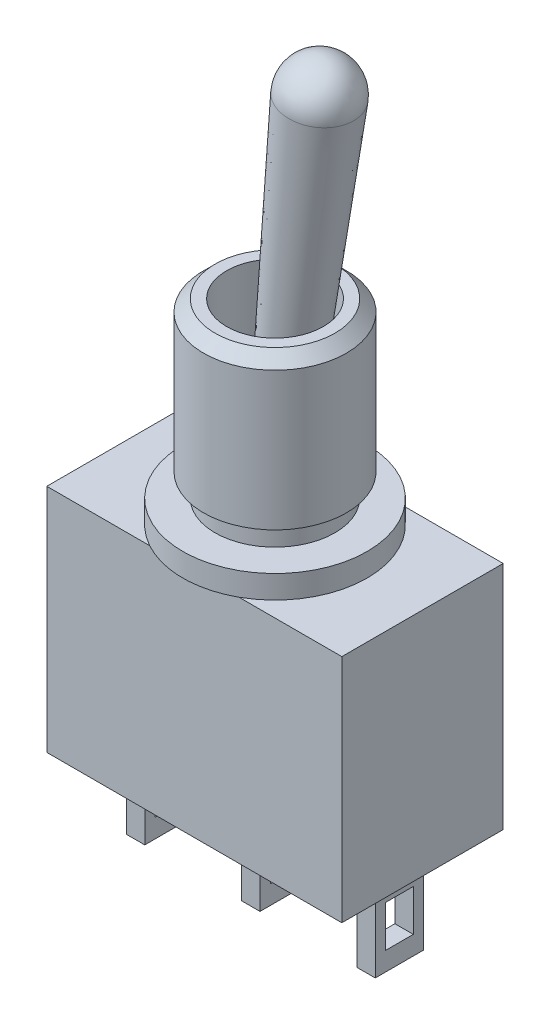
ISO-10303-21;
HEADER;
FILE_DESCRIPTION(('STEP AP214'),'2;1');
FILE_NAME('part.step','',(''),(''),'','','');
FILE_SCHEMA(('AUTOMOTIVE_DESIGN { 1 0 10303 214 1 1 1 1 }'));
ENDSEC;
DATA;
#1=APPLICATION_CONTEXT('core data for automotive mechanical design processes');
#2=APPLICATION_PROTOCOL_DEFINITION('international standard','automotive_design',2000,#1);
#3=PRODUCT_CONTEXT('',#1,'mechanical');
#4=PRODUCT('Part','Part','',(#3));
#5=PRODUCT_RELATED_PRODUCT_CATEGORY('part','',(#4));
#6=PRODUCT_DEFINITION_FORMATION('','',#4);
#7=PRODUCT_DEFINITION_CONTEXT('part definition',#1,'design');
#8=PRODUCT_DEFINITION('design','',#6,#7);
#9=PRODUCT_DEFINITION_SHAPE('','',#8);
#10=(LENGTH_UNIT() NAMED_UNIT(*) SI_UNIT(.MILLI.,.METRE.));
#11=(NAMED_UNIT(*) PLANE_ANGLE_UNIT() SI_UNIT($,.RADIAN.));
#12=(NAMED_UNIT(*) SI_UNIT($,.STERADIAN.) SOLID_ANGLE_UNIT());
#13=UNCERTAINTY_MEASURE_WITH_UNIT(LENGTH_MEASURE(1.E-05),#10,'distance_accuracy_value','');
#14=(GEOMETRIC_REPRESENTATION_CONTEXT(3) GLOBAL_UNCERTAINTY_ASSIGNED_CONTEXT((#13)) GLOBAL_UNIT_ASSIGNED_CONTEXT((#10,
#11,#12)) REPRESENTATION_CONTEXT('',''));
#15=CARTESIAN_POINT('',(0.,0.,0.));
#16=DIRECTION('',(0.,0.,1.));
#17=DIRECTION('',(1.,0.,0.));
#18=AXIS2_PLACEMENT_3D('',#15,#16,#17);
#19=CARTESIAN_POINT('',(0.727270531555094,6.02371910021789,0.));
#20=DIRECTION('',(-0.119864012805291,-0.992790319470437,0.));
#21=DIRECTION('',(0.992790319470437,-0.119864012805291,0.));
#22=AXIS2_PLACEMENT_3D('',#19,#20,#21);
#23=PLANE('',#22);
#24=CARTESIAN_POINT('',(0.,6.11152572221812,0.));
#25=DIRECTION('',(-0.119864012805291,-0.992790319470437,0.));
#26=DIRECTION('',(0.992790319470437,-0.119864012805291,0.));
#27=AXIS2_PLACEMENT_3D('',#24,#25,#26);
#28=CIRCLE('',#27,0.930435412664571);
#29=CARTESIAN_POINT('',(0.923727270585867,6.,0.));
#30=VERTEX_POINT('',#29);
#31=EDGE_CURVE('E11',#30,#30,#28,.T.);
#32=ORIENTED_EDGE('',*,*,#31,.T.);
#33=EDGE_LOOP('',(#32));
#34=FACE_BOUND('',#33,.T.);
#35=ADVANCED_FACE('F42',(#34),#23,.T.);
#36=CARTESIAN_POINT('',(1.9268527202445,22.0709507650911,0.));
#37=DIRECTION('',(0.119864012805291,0.992790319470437,0.));
#38=DIRECTION('',(-0.992790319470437,0.119864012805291,0.));
#39=AXIS2_PLACEMENT_3D('',#36,#37,#38);
#40=CONICAL_SURFACE('',#39,1.5,0.0354161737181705);
#41=ORIENTED_EDGE('',*,*,#31,.F.);
#42=EDGE_LOOP('',(#41));
#43=FACE_BOUND('',#42,.T.);
#44=CARTESIAN_POINT('',(1.9268527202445,22.0709507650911,0.));
#45=DIRECTION('',(-0.119864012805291,-0.992790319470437,0.));
#46=DIRECTION('',(0.992790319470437,-0.119864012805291,0.));
#47=AXIS2_PLACEMENT_3D('',#44,#45,#46);
#48=CIRCLE('',#47,1.5);
#49=CARTESIAN_POINT('',(3.41603819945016,21.8911547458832,0.));
#50=VERTEX_POINT('',#49);
#51=EDGE_CURVE('E48',#50,#50,#48,.T.);
#52=ORIENTED_EDGE('',*,*,#51,.T.);
#53=EDGE_LOOP('',(#52));
#54=FACE_BOUND('',#53,.T.);
#55=ADVANCED_FACE('F54',(#43,#54),#40,.T.);
#56=CARTESIAN_POINT('',(1.93322307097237,22.123714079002,0.));
#57=DIRECTION('',(-0.119864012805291,-0.992790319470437,0.));
#58=DIRECTION('',(-0.992790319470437,0.119864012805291,0.));
#59=AXIS2_PLACEMENT_3D('',#56,#57,#58);
#60=SPHERICAL_SURFACE('',#59,1.50094122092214);
#61=ORIENTED_EDGE('',*,*,#51,.F.);
#62=EDGE_LOOP('',(#61));
#63=FACE_BOUND('',#62,.T.);
#64=ADVANCED_FACE('F56',(#63),#60,.T.);
#65=CLOSED_SHELL('',(#35,#55,#64));
#66=MANIFOLD_SOLID_BREP('B2',#65);
#67=CARTESIAN_POINT('',(6.4,-5.,3.5));
#68=DIRECTION('',(0.,1.,0.));
#69=DIRECTION('',(-1.,0.,0.));
#70=AXIS2_PLACEMENT_3D('',#67,#68,#69);
#71=PLANE('',#70);
#72=DIRECTION('',(-1.,0.,0.));
#73=VECTOR('',#72,1.);
#74=CARTESIAN_POINT('',(-4.6,-5.,1.05));
#75=LINE('',#74,#73);
#76=CARTESIAN_POINT('',(-4.6,-5.,1.05));
#77=VERTEX_POINT('',#76);
#78=CARTESIAN_POINT('',(-5.4,-5.,1.05));
#79=VERTEX_POINT('',#78);
#80=EDGE_CURVE('E394',#77,#79,#75,.T.);
#81=ORIENTED_EDGE('',*,*,#80,.F.);
#82=DIRECTION('',(0.,0.,1.));
#83=VECTOR('',#82,1.);
#84=CARTESIAN_POINT('',(-4.6,-5.,-1.05));
#85=LINE('',#84,#83);
#86=CARTESIAN_POINT('',(-4.6,-5.,-1.05));
#87=VERTEX_POINT('',#86);
#88=EDGE_CURVE('E391',#87,#77,#85,.T.);
#89=ORIENTED_EDGE('',*,*,#88,.F.);
#90=DIRECTION('',(-1.,0.,0.));
#91=VECTOR('',#90,1.);
#92=CARTESIAN_POINT('',(-4.6,-5.,-1.05));
#93=LINE('',#92,#91);
#94=CARTESIAN_POINT('',(-5.4,-5.,-1.05));
#95=VERTEX_POINT('',#94);
#96=EDGE_CURVE('E405',#87,#95,#93,.T.);
#97=ORIENTED_EDGE('',*,*,#96,.T.);
#98=DIRECTION('',(0.,0.,1.));
#99=VECTOR('',#98,1.);
#100=CARTESIAN_POINT('',(-5.4,-5.,-1.05));
#101=LINE('',#100,#99);
#102=EDGE_CURVE('E386',#95,#79,#101,.T.);
#103=ORIENTED_EDGE('',*,*,#102,.T.);
#104=EDGE_LOOP('',(#81,#89,#97,#103));
#105=FACE_BOUND('',#104,.T.);
#106=DIRECTION('',(1.,0.,0.));
#107=VECTOR('',#106,1.);
#108=CARTESIAN_POINT('',(6.4,-5.,-3.5));
#109=LINE('',#108,#107);
#110=CARTESIAN_POINT('',(-6.4,-5.,-3.5));
#111=VERTEX_POINT('',#110);
#112=CARTESIAN_POINT('',(6.4,-5.,-3.5));
#113=VERTEX_POINT('',#112);
#114=EDGE_CURVE('E519',#111,#113,#109,.T.);
#115=ORIENTED_EDGE('',*,*,#114,.T.);
#116=DIRECTION('',(0.,0.,-1.));
#117=VECTOR('',#116,1.);
#118=CARTESIAN_POINT('',(6.4,-5.,3.5));
#119=LINE('',#118,#117);
#120=CARTESIAN_POINT('',(6.4,-5.,3.5));
#121=VERTEX_POINT('',#120);
#122=EDGE_CURVE('E531',#121,#113,#119,.T.);
#123=ORIENTED_EDGE('',*,*,#122,.F.);
#124=DIRECTION('',(1.,0.,0.));
#125=VECTOR('',#124,1.);
#126=CARTESIAN_POINT('',(6.4,-5.,3.5));
#127=LINE('',#126,#125);
#128=CARTESIAN_POINT('',(-6.4,-5.,3.5));
#129=VERTEX_POINT('',#128);
#130=EDGE_CURVE('E506',#129,#121,#127,.T.);
#131=ORIENTED_EDGE('',*,*,#130,.F.);
#132=DIRECTION('',(0.,0.,-1.));
#133=VECTOR('',#132,1.);
#134=CARTESIAN_POINT('',(-6.4,-5.,3.5));
#135=LINE('',#134,#133);
#136=EDGE_CURVE('E86',#129,#111,#135,.T.);
#137=ORIENTED_EDGE('',*,*,#136,.T.);
#138=EDGE_LOOP('',(#115,#123,#131,#137));
#139=FACE_BOUND('',#138,.T.);
#140=DIRECTION('',(-1.,0.,0.));
#141=VECTOR('',#140,1.);
#142=CARTESIAN_POINT('',(0.4,-5.,1.05));
#143=LINE('',#142,#141);
#144=CARTESIAN_POINT('',(0.4,-5.,1.05));
#145=VERTEX_POINT('',#144);
#146=CARTESIAN_POINT('',(-0.4,-5.,1.05));
#147=VERTEX_POINT('',#146);
#148=EDGE_CURVE('E457',#145,#147,#143,.T.);
#149=ORIENTED_EDGE('',*,*,#148,.F.);
#150=DIRECTION('',(0.,0.,1.));
#151=VECTOR('',#150,1.);
#152=CARTESIAN_POINT('',(0.4,-5.,-1.05));
#153=LINE('',#152,#151);
#154=CARTESIAN_POINT('',(0.4,-5.,-1.05));
#155=VERTEX_POINT('',#154);
#156=EDGE_CURVE('E454',#155,#145,#153,.T.);
#157=ORIENTED_EDGE('',*,*,#156,.F.);
#158=DIRECTION('',(-1.,0.,0.));
#159=VECTOR('',#158,1.);
#160=CARTESIAN_POINT('',(0.4,-5.,-1.05));
#161=LINE('',#160,#159);
#162=CARTESIAN_POINT('',(-0.4,-5.,-1.05));
#163=VERTEX_POINT('',#162);
#164=EDGE_CURVE('E468',#155,#163,#161,.T.);
#165=ORIENTED_EDGE('',*,*,#164,.T.);
#166=DIRECTION('',(0.,0.,1.));
#167=VECTOR('',#166,1.);
#168=CARTESIAN_POINT('',(-0.4,-5.,-1.05));
#169=LINE('',#168,#167);
#170=EDGE_CURVE('E449',#163,#147,#169,.T.);
#171=ORIENTED_EDGE('',*,*,#170,.T.);
#172=EDGE_LOOP('',(#149,#157,#165,#171));
#173=FACE_BOUND('',#172,.T.);
#174=DIRECTION('',(-1.,0.,0.));
#175=VECTOR('',#174,1.);
#176=CARTESIAN_POINT('',(5.4,-5.,1.05));
#177=LINE('',#176,#175);
#178=CARTESIAN_POINT('',(5.4,-5.,1.05));
#179=VERTEX_POINT('',#178);
#180=CARTESIAN_POINT('',(4.6,-5.,1.05));
#181=VERTEX_POINT('',#180);
#182=EDGE_CURVE('E100',#179,#181,#177,.T.);
#183=ORIENTED_EDGE('',*,*,#182,.F.);
#184=DIRECTION('',(0.,0.,1.));
#185=VECTOR('',#184,1.);
#186=CARTESIAN_POINT('',(5.4,-5.,-1.05));
#187=LINE('',#186,#185);
#188=CARTESIAN_POINT('',(5.4,-5.,-1.05));
#189=VERTEX_POINT('',#188);
#190=EDGE_CURVE('E331',#189,#179,#187,.T.);
#191=ORIENTED_EDGE('',*,*,#190,.F.);
#192=DIRECTION('',(-1.,0.,0.));
#193=VECTOR('',#192,1.);
#194=CARTESIAN_POINT('',(5.4,-5.,-1.05));
#195=LINE('',#194,#193);
#196=CARTESIAN_POINT('',(4.6,-5.,-1.05));
#197=VERTEX_POINT('',#196);
#198=EDGE_CURVE('E342',#189,#197,#195,.T.);
#199=ORIENTED_EDGE('',*,*,#198,.T.);
#200=DIRECTION('',(0.,0.,1.));
#201=VECTOR('',#200,1.);
#202=CARTESIAN_POINT('',(4.6,-5.,-1.05));
#203=LINE('',#202,#201);
#204=EDGE_CURVE('E105',#197,#181,#203,.T.);
#205=ORIENTED_EDGE('',*,*,#204,.T.);
#206=EDGE_LOOP('',(#183,#191,#199,#205));
#207=FACE_BOUND('',#206,.T.);
#208=ADVANCED_FACE('F82',(#105,#139,#173,#207),#71,.F.);
#209=CARTESIAN_POINT('',(6.4,5.,3.5));
#210=DIRECTION('',(0.,-1.,0.));
#211=DIRECTION('',(1.,0.,0.));
#212=AXIS2_PLACEMENT_3D('',#209,#210,#211);
#213=PLANE('',#212);
#214=DIRECTION('',(-1.,0.,0.));
#215=VECTOR('',#214,1.);
#216=CARTESIAN_POINT('',(6.4,5.,3.5));
#217=LINE('',#216,#215);
#218=CARTESIAN_POINT('',(-1.93649167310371,5.,3.5));
#219=VERTEX_POINT('',#218);
#220=CARTESIAN_POINT('',(-6.4,5.,3.5));
#221=VERTEX_POINT('',#220);
#222=EDGE_CURVE('E511',#219,#221,#217,.T.);
#223=ORIENTED_EDGE('',*,*,#222,.F.);
#224=CARTESIAN_POINT('',(0.,5.,0.));
#225=DIRECTION('',(0.,-1.,0.));
#226=DIRECTION('',(1.,0.,0.));
#227=AXIS2_PLACEMENT_3D('',#224,#225,#226);
#228=CIRCLE('',#227,4.);
#229=CARTESIAN_POINT('',(-1.93649167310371,5.,-3.5));
#230=VERTEX_POINT('',#229);
#231=EDGE_CURVE('E40',#219,#230,#228,.T.);
#232=ORIENTED_EDGE('',*,*,#231,.T.);
#233=DIRECTION('',(-1.,0.,0.));
#234=VECTOR('',#233,1.);
#235=CARTESIAN_POINT('',(6.4,5.,-3.5));
#236=LINE('',#235,#234);
#237=CARTESIAN_POINT('',(-6.4,5.,-3.5));
#238=VERTEX_POINT('',#237);
#239=EDGE_CURVE('E523',#230,#238,#236,.T.);
#240=ORIENTED_EDGE('',*,*,#239,.T.);
#241=DIRECTION('',(0.,0.,-1.));
#242=VECTOR('',#241,1.);
#243=CARTESIAN_POINT('',(-6.4,5.,3.5));
#244=LINE('',#243,#242);
#245=EDGE_CURVE('E515',#221,#238,#244,.T.);
#246=ORIENTED_EDGE('',*,*,#245,.F.);
#247=EDGE_LOOP('',(#223,#232,#240,#246));
#248=FACE_BOUND('',#247,.T.);
#249=ADVANCED_FACE('F563',(#248),#213,.F.);
#250=CARTESIAN_POINT('',(-6.4,-5.,3.5));
#251=DIRECTION('',(1.,0.,0.));
#252=DIRECTION('',(0.,0.,-1.));
#253=AXIS2_PLACEMENT_3D('',#250,#251,#252);
#254=PLANE('',#253);
#255=DIRECTION('',(0.,-1.,0.));
#256=VECTOR('',#255,1.);
#257=CARTESIAN_POINT('',(-6.4,-5.,-3.5));
#258=LINE('',#257,#256);
#259=EDGE_CURVE('E502',#238,#111,#258,.T.);
#260=ORIENTED_EDGE('',*,*,#259,.T.);
#261=ORIENTED_EDGE('',*,*,#136,.F.);
#262=DIRECTION('',(0.,-1.,0.));
#263=VECTOR('',#262,1.);
#264=CARTESIAN_POINT('',(-6.4,-5.,3.5));
#265=LINE('',#264,#263);
#266=EDGE_CURVE('E503',#221,#129,#265,.T.);
#267=ORIENTED_EDGE('',*,*,#266,.F.);
#268=ORIENTED_EDGE('',*,*,#245,.T.);
#269=EDGE_LOOP('',(#260,#261,#267,#268));
#270=FACE_BOUND('',#269,.T.);
#271=ADVANCED_FACE('F84',(#270),#254,.F.);
#272=CARTESIAN_POINT('',(6.4,-5.,3.5));
#273=DIRECTION('',(-1.,0.,0.));
#274=DIRECTION('',(0.,0.,1.));
#275=AXIS2_PLACEMENT_3D('',#272,#273,#274);
#276=PLANE('',#275);
#277=DIRECTION('',(0.,1.,0.));
#278=VECTOR('',#277,1.);
#279=CARTESIAN_POINT('',(6.4,-5.,-3.5));
#280=LINE('',#279,#278);
#281=CARTESIAN_POINT('',(6.4,5.,-3.5));
#282=VERTEX_POINT('',#281);
#283=EDGE_CURVE('E521',#113,#282,#280,.T.);
#284=ORIENTED_EDGE('',*,*,#283,.T.);
#285=DIRECTION('',(0.,0.,-1.));
#286=VECTOR('',#285,1.);
#287=CARTESIAN_POINT('',(6.4,5.,3.5));
#288=LINE('',#287,#286);
#289=CARTESIAN_POINT('',(6.4,5.,3.5));
#290=VERTEX_POINT('',#289);
#291=EDGE_CURVE('E529',#290,#282,#288,.T.);
#292=ORIENTED_EDGE('',*,*,#291,.F.);
#293=DIRECTION('',(0.,1.,0.));
#294=VECTOR('',#293,1.);
#295=CARTESIAN_POINT('',(6.4,-5.,3.5));
#296=LINE('',#295,#294);
#297=EDGE_CURVE('E509',#121,#290,#296,.T.);
#298=ORIENTED_EDGE('',*,*,#297,.F.);
#299=ORIENTED_EDGE('',*,*,#122,.T.);
#300=EDGE_LOOP('',(#284,#292,#298,#299));
#301=FACE_BOUND('',#300,.T.);
#302=ADVANCED_FACE('F553',(#301),#276,.F.);
#303=CARTESIAN_POINT('',(1.93649167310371,5.,-3.5));
#304=VERTEX_POINT('',#303);
#305=EDGE_CURVE('E507',#282,#304,#236,.T.);
#306=ORIENTED_EDGE('',*,*,#305,.T.);
#307=CARTESIAN_POINT('',(1.93649167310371,5.,3.5));
#308=VERTEX_POINT('',#307);
#309=EDGE_CURVE('E91',#304,#308,#228,.T.);
#310=ORIENTED_EDGE('',*,*,#309,.T.);
#311=EDGE_CURVE('E512',#290,#308,#217,.T.);
#312=ORIENTED_EDGE('',*,*,#311,.F.);
#313=ORIENTED_EDGE('',*,*,#291,.T.);
#314=EDGE_LOOP('',(#306,#310,#312,#313));
#315=FACE_BOUND('',#314,.T.);
#316=ADVANCED_FACE('F543',(#315),#213,.F.);
#317=CARTESIAN_POINT('',(0.,0.,3.5));
#318=DIRECTION('',(0.,0.,1.));
#319=DIRECTION('',(1.,0.,0.));
#320=AXIS2_PLACEMENT_3D('',#317,#318,#319);
#321=PLANE('',#320);
#322=ORIENTED_EDGE('',*,*,#266,.T.);
#323=ORIENTED_EDGE('',*,*,#130,.T.);
#324=ORIENTED_EDGE('',*,*,#297,.T.);
#325=ORIENTED_EDGE('',*,*,#311,.T.);
#326=EDGE_CURVE('E516',#308,#219,#217,.T.);
#327=ORIENTED_EDGE('',*,*,#326,.T.);
#328=ORIENTED_EDGE('',*,*,#222,.T.);
#329=EDGE_LOOP('',(#322,#323,#324,#325,#327,#328));
#330=FACE_BOUND('',#329,.T.);
#331=ADVANCED_FACE('F550',(#330),#321,.T.);
#332=CARTESIAN_POINT('',(0.,0.,-3.5));
#333=DIRECTION('',(0.,0.,1.));
#334=DIRECTION('',(1.,0.,0.));
#335=AXIS2_PLACEMENT_3D('',#332,#333,#334);
#336=PLANE('',#335);
#337=ORIENTED_EDGE('',*,*,#259,.F.);
#338=ORIENTED_EDGE('',*,*,#239,.F.);
#339=EDGE_CURVE('E526',#304,#230,#236,.T.);
#340=ORIENTED_EDGE('',*,*,#339,.F.);
#341=ORIENTED_EDGE('',*,*,#305,.F.);
#342=ORIENTED_EDGE('',*,*,#283,.F.);
#343=ORIENTED_EDGE('',*,*,#114,.F.);
#344=EDGE_LOOP('',(#337,#338,#340,#341,#342,#343));
#345=FACE_BOUND('',#344,.T.);
#346=ADVANCED_FACE('F557',(#345),#336,.F.);
#347=CARTESIAN_POINT('',(4.,5.,0.));
#348=DIRECTION('',(0.,-1.,0.));
#349=DIRECTION('',(1.,0.,0.));
#350=AXIS2_PLACEMENT_3D('',#347,#348,#349);
#351=PLANE('',#350);
#352=ORIENTED_EDGE('',*,*,#326,.F.);
#353=EDGE_CURVE('E499',#308,#219,#228,.T.);
#354=ORIENTED_EDGE('',*,*,#353,.T.);
#355=EDGE_LOOP('',(#352,#354));
#356=FACE_BOUND('',#355,.T.);
#357=ADVANCED_FACE('F668',(#356),#351,.T.);
#358=EDGE_CURVE('E93',#230,#304,#228,.T.);
#359=ORIENTED_EDGE('',*,*,#358,.T.);
#360=ORIENTED_EDGE('',*,*,#339,.T.);
#361=EDGE_LOOP('',(#359,#360));
#362=FACE_BOUND('',#361,.T.);
#363=ADVANCED_FACE('F664',(#362),#351,.T.);
#364=CARTESIAN_POINT('',(0.,5.,0.));
#365=DIRECTION('',(0.,-1.,0.));
#366=DIRECTION('',(1.,0.,0.));
#367=AXIS2_PLACEMENT_3D('',#364,#365,#366);
#368=CYLINDRICAL_SURFACE('',#367,4.);
#369=CARTESIAN_POINT('',(0.,6.,0.));
#370=DIRECTION('',(0.,-1.,0.));
#371=DIRECTION('',(1.,0.,0.));
#372=AXIS2_PLACEMENT_3D('',#369,#370,#371);
#373=CIRCLE('',#372,4.);
#374=CARTESIAN_POINT('',(4.,6.,0.));
#375=VERTEX_POINT('',#374);
#376=EDGE_CURVE('E497',#375,#375,#373,.T.);
#377=ORIENTED_EDGE('',*,*,#376,.T.);
#378=EDGE_LOOP('',(#377));
#379=FACE_BOUND('',#378,.T.);
#380=ORIENTED_EDGE('',*,*,#353,.F.);
#381=ORIENTED_EDGE('',*,*,#309,.F.);
#382=ORIENTED_EDGE('',*,*,#358,.F.);
#383=ORIENTED_EDGE('',*,*,#231,.F.);
#384=EDGE_LOOP('',(#380,#381,#382,#383));
#385=FACE_BOUND('',#384,.T.);
#386=ADVANCED_FACE('F660',(#379,#385),#368,.T.);
#387=CARTESIAN_POINT('',(2.6,6.,0.));
#388=DIRECTION('',(0.,1.,0.));
#389=DIRECTION('',(-1.,0.,0.));
#390=AXIS2_PLACEMENT_3D('',#387,#388,#389);
#391=PLANE('',#390);
#392=CARTESIAN_POINT('',(0.,6.,0.));
#393=DIRECTION('',(0.,-1.,0.));
#394=DIRECTION('',(1.,0.,0.));
#395=AXIS2_PLACEMENT_3D('',#392,#393,#394);
#396=CIRCLE('',#395,2.6);
#397=CARTESIAN_POINT('',(2.6,6.,0.));
#398=VERTEX_POINT('',#397);
#399=EDGE_CURVE('E494',#398,#398,#396,.T.);
#400=ORIENTED_EDGE('',*,*,#399,.T.);
#401=EDGE_LOOP('',(#400));
#402=FACE_BOUND('',#401,.T.);
#403=ORIENTED_EDGE('',*,*,#376,.F.);
#404=EDGE_LOOP('',(#403));
#405=FACE_BOUND('',#404,.T.);
#406=ADVANCED_FACE('F656',(#402,#405),#391,.T.);
#407=CARTESIAN_POINT('',(0.,5.,0.));
#408=DIRECTION('',(0.,-1.,0.));
#409=DIRECTION('',(1.,0.,0.));
#410=AXIS2_PLACEMENT_3D('',#407,#408,#409);
#411=CYLINDRICAL_SURFACE('',#410,2.6);
#412=CARTESIAN_POINT('',(0.,7.,0.));
#413=DIRECTION('',(0.,-1.,0.));
#414=DIRECTION('',(1.,0.,0.));
#415=AXIS2_PLACEMENT_3D('',#412,#413,#414);
#416=CIRCLE('',#415,2.6);
#417=CARTESIAN_POINT('',(2.6,7.,0.));
#418=VERTEX_POINT('',#417);
#419=EDGE_CURVE('E491',#418,#418,#416,.T.);
#420=ORIENTED_EDGE('',*,*,#419,.T.);
#421=EDGE_LOOP('',(#420));
#422=FACE_BOUND('',#421,.T.);
#423=ORIENTED_EDGE('',*,*,#399,.F.);
#424=EDGE_LOOP('',(#423));
#425=FACE_BOUND('',#424,.T.);
#426=ADVANCED_FACE('F652',(#422,#425),#411,.T.);
#427=CARTESIAN_POINT('',(2.6,7.,0.));
#428=DIRECTION('',(0.,-1.,0.));
#429=DIRECTION('',(1.,0.,0.));
#430=AXIS2_PLACEMENT_3D('',#427,#428,#429);
#431=PLANE('',#430);
#432=CARTESIAN_POINT('',(0.,7.,0.));
#433=DIRECTION('',(0.,-1.,0.));
#434=DIRECTION('',(1.,0.,0.));
#435=AXIS2_PLACEMENT_3D('',#432,#433,#434);
#436=CIRCLE('',#435,3.1);
#437=CARTESIAN_POINT('',(3.1,7.,0.));
#438=VERTEX_POINT('',#437);
#439=EDGE_CURVE('E488',#438,#438,#436,.T.);
#440=ORIENTED_EDGE('',*,*,#439,.T.);
#441=EDGE_LOOP('',(#440));
#442=FACE_BOUND('',#441,.T.);
#443=ORIENTED_EDGE('',*,*,#419,.F.);
#444=EDGE_LOOP('',(#443));
#445=FACE_BOUND('',#444,.T.);
#446=ADVANCED_FACE('F648',(#442,#445),#431,.T.);
#447=CARTESIAN_POINT('',(0.,5.,0.));
#448=DIRECTION('',(0.,-1.,0.));
#449=DIRECTION('',(1.,0.,0.));
#450=AXIS2_PLACEMENT_3D('',#447,#448,#449);
#451=CYLINDRICAL_SURFACE('',#450,3.1);
#452=CARTESIAN_POINT('',(0.,13.,0.));
#453=DIRECTION('',(0.,-1.,0.));
#454=DIRECTION('',(1.,0.,0.));
#455=AXIS2_PLACEMENT_3D('',#452,#453,#454);
#456=CIRCLE('',#455,3.1);
#457=CARTESIAN_POINT('',(3.1,13.,0.));
#458=VERTEX_POINT('',#457);
#459=EDGE_CURVE('E485',#458,#458,#456,.T.);
#460=ORIENTED_EDGE('',*,*,#459,.T.);
#461=EDGE_LOOP('',(#460));
#462=FACE_BOUND('',#461,.T.);
#463=ORIENTED_EDGE('',*,*,#439,.F.);
#464=EDGE_LOOP('',(#463));
#465=FACE_BOUND('',#464,.T.);
#466=ADVANCED_FACE('F644',(#462,#465),#451,.T.);
#467=CARTESIAN_POINT('',(0.,13.,0.));
#468=DIRECTION('',(0.,-1.,0.));
#469=DIRECTION('',(1.,0.,0.));
#470=AXIS2_PLACEMENT_3D('',#467,#468,#469);
#471=CONICAL_SURFACE('',#470,3.1,0.785398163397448);
#472=CARTESIAN_POINT('',(0.,13.5,0.));
#473=DIRECTION('',(0.,-1.,0.));
#474=DIRECTION('',(1.,0.,0.));
#475=AXIS2_PLACEMENT_3D('',#472,#473,#474);
#476=CIRCLE('',#475,2.6);
#477=CARTESIAN_POINT('',(2.6,13.5,0.));
#478=VERTEX_POINT('',#477);
#479=EDGE_CURVE('E482',#478,#478,#476,.T.);
#480=ORIENTED_EDGE('',*,*,#479,.T.);
#481=EDGE_LOOP('',(#480));
#482=FACE_BOUND('',#481,.T.);
#483=ORIENTED_EDGE('',*,*,#459,.F.);
#484=EDGE_LOOP('',(#483));
#485=FACE_BOUND('',#484,.T.);
#486=ADVANCED_FACE('F640',(#482,#485),#471,.T.);
#487=CARTESIAN_POINT('',(2.1,13.5,0.));
#488=DIRECTION('',(0.,1.,0.));
#489=DIRECTION('',(-1.,0.,0.));
#490=AXIS2_PLACEMENT_3D('',#487,#488,#489);
#491=PLANE('',#490);
#492=CARTESIAN_POINT('',(0.,13.5,0.));
#493=DIRECTION('',(0.,-1.,0.));
#494=DIRECTION('',(1.,0.,0.));
#495=AXIS2_PLACEMENT_3D('',#492,#493,#494);
#496=CIRCLE('',#495,2.1);
#497=CARTESIAN_POINT('',(2.1,13.5,0.));
#498=VERTEX_POINT('',#497);
#499=EDGE_CURVE('E479',#498,#498,#496,.T.);
#500=ORIENTED_EDGE('',*,*,#499,.T.);
#501=EDGE_LOOP('',(#500));
#502=FACE_BOUND('',#501,.T.);
#503=ORIENTED_EDGE('',*,*,#479,.F.);
#504=EDGE_LOOP('',(#503));
#505=FACE_BOUND('',#504,.T.);
#506=ADVANCED_FACE('F636',(#502,#505),#491,.T.);
#507=CARTESIAN_POINT('',(0.,5.,0.));
#508=DIRECTION('',(0.,-1.,0.));
#509=DIRECTION('',(1.,0.,0.));
#510=AXIS2_PLACEMENT_3D('',#507,#508,#509);
#511=CYLINDRICAL_SURFACE('',#510,2.1);
#512=CARTESIAN_POINT('',(0.,6.,0.));
#513=DIRECTION('',(0.,-1.,0.));
#514=DIRECTION('',(1.,0.,0.));
#515=AXIS2_PLACEMENT_3D('',#512,#513,#514);
#516=CIRCLE('',#515,2.1);
#517=CARTESIAN_POINT('',(2.1,6.,0.));
#518=VERTEX_POINT('',#517);
#519=EDGE_CURVE('E476',#518,#518,#516,.T.);
#520=ORIENTED_EDGE('',*,*,#519,.T.);
#521=EDGE_LOOP('',(#520));
#522=FACE_BOUND('',#521,.T.);
#523=ORIENTED_EDGE('',*,*,#499,.F.);
#524=EDGE_LOOP('',(#523));
#525=FACE_BOUND('',#524,.T.);
#526=ADVANCED_FACE('F632',(#522,#525),#511,.F.);
#527=CARTESIAN_POINT('',(0.,6.,0.));
#528=DIRECTION('',(0.,-1.,0.));
#529=DIRECTION('',(1.,0.,0.));
#530=AXIS2_PLACEMENT_3D('',#527,#528,#529);
#531=SPHERICAL_SURFACE('',#530,2.1);
#532=ORIENTED_EDGE('',*,*,#519,.F.);
#533=EDGE_LOOP('',(#532));
#534=FACE_BOUND('',#533,.T.);
#535=ADVANCED_FACE('F622',(#534),#531,.T.);
#536=CARTESIAN_POINT('',(0.4,0.,0.));
#537=DIRECTION('',(1.,0.,0.));
#538=DIRECTION('',(0.,0.,-1.));
#539=AXIS2_PLACEMENT_3D('',#536,#537,#538);
#540=PLANE('',#539);
#541=DIRECTION('',(0.,-1.,0.));
#542=VECTOR('',#541,1.);
#543=CARTESIAN_POINT('',(0.4,-8.8,1.05));
#544=LINE('',#543,#542);
#545=CARTESIAN_POINT('',(0.4,-8.8,1.05));
#546=VERTEX_POINT('',#545);
#547=EDGE_CURVE('E445',#145,#546,#544,.T.);
#548=ORIENTED_EDGE('',*,*,#547,.T.);
#549=DIRECTION('',(0.,0.,-1.));
#550=VECTOR('',#549,1.);
#551=CARTESIAN_POINT('',(0.4,-8.8,-1.05));
#552=LINE('',#551,#550);
#553=CARTESIAN_POINT('',(0.4,-8.8,-1.05));
#554=VERTEX_POINT('',#553);
#555=EDGE_CURVE('E448',#546,#554,#552,.T.);
#556=ORIENTED_EDGE('',*,*,#555,.T.);
#557=DIRECTION('',(0.,1.,0.));
#558=VECTOR('',#557,1.);
#559=CARTESIAN_POINT('',(0.4,-8.8,-1.05));
#560=LINE('',#559,#558);
#561=EDGE_CURVE('E451',#554,#155,#560,.T.);
#562=ORIENTED_EDGE('',*,*,#561,.T.);
#563=ORIENTED_EDGE('',*,*,#156,.T.);
#564=EDGE_LOOP('',(#548,#556,#562,#563));
#565=FACE_BOUND('',#564,.T.);
#566=DIRECTION('',(0.,0.,-1.));
#567=VECTOR('',#566,1.);
#568=CARTESIAN_POINT('',(0.4,-7.98571428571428,-0.6));
#569=LINE('',#568,#567);
#570=CARTESIAN_POINT('',(0.4,-7.98571428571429,0.6));
#571=VERTEX_POINT('',#570);
#572=CARTESIAN_POINT('',(0.4,-7.98571428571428,-0.6));
#573=VERTEX_POINT('',#572);
#574=EDGE_CURVE('E416',#571,#573,#569,.T.);
#575=ORIENTED_EDGE('',*,*,#574,.F.);
#576=DIRECTION('',(0.,-1.,0.));
#577=VECTOR('',#576,1.);
#578=CARTESIAN_POINT('',(0.4,-7.98571428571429,0.6));
#579=LINE('',#578,#577);
#580=CARTESIAN_POINT('',(0.4,-6.18571428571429,0.6));
#581=VERTEX_POINT('',#580);
#582=EDGE_CURVE('E414',#581,#571,#579,.T.);
#583=ORIENTED_EDGE('',*,*,#582,.F.);
#584=DIRECTION('',(0.,0.,1.));
#585=VECTOR('',#584,1.);
#586=CARTESIAN_POINT('',(0.4,-6.18571428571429,-0.6));
#587=LINE('',#586,#585);
#588=CARTESIAN_POINT('',(0.4,-6.18571428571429,-0.6));
#589=VERTEX_POINT('',#588);
#590=EDGE_CURVE('E422',#589,#581,#587,.T.);
#591=ORIENTED_EDGE('',*,*,#590,.F.);
#592=DIRECTION('',(0.,1.,0.));
#593=VECTOR('',#592,1.);
#594=CARTESIAN_POINT('',(0.4,-7.98571428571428,-0.6));
#595=LINE('',#594,#593);
#596=EDGE_CURVE('E419',#573,#589,#595,.T.);
#597=ORIENTED_EDGE('',*,*,#596,.F.);
#598=EDGE_LOOP('',(#575,#583,#591,#597));
#599=FACE_BOUND('',#598,.T.);
#600=ADVANCED_FACE('F574',(#565,#599),#540,.T.);
#601=CARTESIAN_POINT('',(-0.4,0.,0.));
#602=DIRECTION('',(1.,0.,0.));
#603=DIRECTION('',(0.,0.,-1.));
#604=AXIS2_PLACEMENT_3D('',#601,#602,#603);
#605=PLANE('',#604);
#606=DIRECTION('',(0.,-1.,0.));
#607=VECTOR('',#606,1.);
#608=CARTESIAN_POINT('',(-0.4,-8.8,1.05));
#609=LINE('',#608,#607);
#610=CARTESIAN_POINT('',(-0.4,-8.8,1.05));
#611=VERTEX_POINT('',#610);
#612=EDGE_CURVE('E444',#147,#611,#609,.T.);
#613=ORIENTED_EDGE('',*,*,#612,.F.);
#614=ORIENTED_EDGE('',*,*,#170,.F.);
#615=DIRECTION('',(0.,1.,0.));
#616=VECTOR('',#615,1.);
#617=CARTESIAN_POINT('',(-0.4,-8.8,-1.05));
#618=LINE('',#617,#616);
#619=CARTESIAN_POINT('',(-0.4,-8.8,-1.05));
#620=VERTEX_POINT('',#619);
#621=EDGE_CURVE('E462',#620,#163,#618,.T.);
#622=ORIENTED_EDGE('',*,*,#621,.F.);
#623=DIRECTION('',(0.,0.,-1.));
#624=VECTOR('',#623,1.);
#625=CARTESIAN_POINT('',(-0.4,-8.8,-1.05));
#626=LINE('',#625,#624);
#627=EDGE_CURVE('E460',#611,#620,#626,.T.);
#628=ORIENTED_EDGE('',*,*,#627,.F.);
#629=EDGE_LOOP('',(#613,#614,#622,#628));
#630=FACE_BOUND('',#629,.T.);
#631=DIRECTION('',(0.,-1.,0.));
#632=VECTOR('',#631,1.);
#633=CARTESIAN_POINT('',(-0.4,-7.98571428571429,0.6));
#634=LINE('',#633,#632);
#635=CARTESIAN_POINT('',(-0.4,-6.18571428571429,0.6));
#636=VERTEX_POINT('',#635);
#637=CARTESIAN_POINT('',(-0.4,-7.98571428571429,0.6));
#638=VERTEX_POINT('',#637);
#639=EDGE_CURVE('E413',#636,#638,#634,.T.);
#640=ORIENTED_EDGE('',*,*,#639,.T.);
#641=DIRECTION('',(0.,0.,-1.));
#642=VECTOR('',#641,1.);
#643=CARTESIAN_POINT('',(-0.4,-7.98571428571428,-0.6));
#644=LINE('',#643,#642);
#645=CARTESIAN_POINT('',(-0.4,-7.98571428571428,-0.6));
#646=VERTEX_POINT('',#645);
#647=EDGE_CURVE('E427',#638,#646,#644,.T.);
#648=ORIENTED_EDGE('',*,*,#647,.T.);
#649=DIRECTION('',(0.,1.,0.));
#650=VECTOR('',#649,1.);
#651=CARTESIAN_POINT('',(-0.4,-7.98571428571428,-0.6));
#652=LINE('',#651,#650);
#653=CARTESIAN_POINT('',(-0.4,-6.18571428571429,-0.6));
#654=VERTEX_POINT('',#653);
#655=EDGE_CURVE('E430',#646,#654,#652,.T.);
#656=ORIENTED_EDGE('',*,*,#655,.T.);
#657=DIRECTION('',(0.,0.,1.));
#658=VECTOR('',#657,1.);
#659=CARTESIAN_POINT('',(-0.4,-6.18571428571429,-0.6));
#660=LINE('',#659,#658);
#661=EDGE_CURVE('E417',#654,#636,#660,.T.);
#662=ORIENTED_EDGE('',*,*,#661,.T.);
#663=EDGE_LOOP('',(#640,#648,#656,#662));
#664=FACE_BOUND('',#663,.T.);
#665=ADVANCED_FACE('F587',(#630,#664),#605,.F.);
#666=CARTESIAN_POINT('',(0.4,-8.8,1.05));
#667=DIRECTION('',(0.,0.,-1.));
#668=DIRECTION('',(-1.,0.,0.));
#669=AXIS2_PLACEMENT_3D('',#666,#667,#668);
#670=PLANE('',#669);
#671=ORIENTED_EDGE('',*,*,#612,.T.);
#672=DIRECTION('',(-1.,0.,0.));
#673=VECTOR('',#672,1.);
#674=CARTESIAN_POINT('',(0.4,-8.8,1.05));
#675=LINE('',#674,#673);
#676=EDGE_CURVE('E473',#546,#611,#675,.T.);
#677=ORIENTED_EDGE('',*,*,#676,.F.);
#678=ORIENTED_EDGE('',*,*,#547,.F.);
#679=ORIENTED_EDGE('',*,*,#148,.T.);
#680=EDGE_LOOP('',(#671,#677,#678,#679));
#681=FACE_BOUND('',#680,.T.);
#682=ADVANCED_FACE('F579',(#681),#670,.F.);
#683=CARTESIAN_POINT('',(0.4,-8.8,-1.05));
#684=DIRECTION('',(0.,1.,0.));
#685=DIRECTION('',(0.,0.,1.));
#686=AXIS2_PLACEMENT_3D('',#683,#684,#685);
#687=PLANE('',#686);
#688=ORIENTED_EDGE('',*,*,#627,.T.);
#689=DIRECTION('',(-1.,0.,0.));
#690=VECTOR('',#689,1.);
#691=CARTESIAN_POINT('',(0.4,-8.8,-1.05));
#692=LINE('',#691,#690);
#693=EDGE_CURVE('E470',#554,#620,#692,.T.);
#694=ORIENTED_EDGE('',*,*,#693,.F.);
#695=ORIENTED_EDGE('',*,*,#555,.F.);
#696=ORIENTED_EDGE('',*,*,#676,.T.);
#697=EDGE_LOOP('',(#688,#694,#695,#696));
#698=FACE_BOUND('',#697,.T.);
#699=ADVANCED_FACE('F581',(#698),#687,.F.);
#700=CARTESIAN_POINT('',(0.4,-8.8,-1.05));
#701=DIRECTION('',(0.,0.,1.));
#702=DIRECTION('',(1.,0.,0.));
#703=AXIS2_PLACEMENT_3D('',#700,#701,#702);
#704=PLANE('',#703);
#705=ORIENTED_EDGE('',*,*,#621,.T.);
#706=ORIENTED_EDGE('',*,*,#164,.F.);
#707=ORIENTED_EDGE('',*,*,#561,.F.);
#708=ORIENTED_EDGE('',*,*,#693,.T.);
#709=EDGE_LOOP('',(#705,#706,#707,#708));
#710=FACE_BOUND('',#709,.T.);
#711=ADVANCED_FACE('F585',(#710),#704,.F.);
#712=CARTESIAN_POINT('',(0.4,-7.98571428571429,0.6));
#713=DIRECTION('',(0.,0.,-1.));
#714=DIRECTION('',(-1.,0.,0.));
#715=AXIS2_PLACEMENT_3D('',#712,#713,#714);
#716=PLANE('',#715);
#717=ORIENTED_EDGE('',*,*,#639,.F.);
#718=DIRECTION('',(-1.,0.,0.));
#719=VECTOR('',#718,1.);
#720=CARTESIAN_POINT('',(0.4,-6.18571428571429,0.6));
#721=LINE('',#720,#719);
#722=EDGE_CURVE('E424',#581,#636,#721,.T.);
#723=ORIENTED_EDGE('',*,*,#722,.F.);
#724=ORIENTED_EDGE('',*,*,#582,.T.);
#725=DIRECTION('',(-1.,0.,0.));
#726=VECTOR('',#725,1.);
#727=CARTESIAN_POINT('',(0.4,-7.98571428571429,0.6));
#728=LINE('',#727,#726);
#729=EDGE_CURVE('E441',#571,#638,#728,.T.);
#730=ORIENTED_EDGE('',*,*,#729,.T.);
#731=EDGE_LOOP('',(#717,#723,#724,#730));
#732=FACE_BOUND('',#731,.T.);
#733=ADVANCED_FACE('F594',(#732),#716,.T.);
#734=CARTESIAN_POINT('',(0.4,-7.98571428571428,-0.6));
#735=DIRECTION('',(0.,1.,0.));
#736=DIRECTION('',(0.,0.,1.));
#737=AXIS2_PLACEMENT_3D('',#734,#735,#736);
#738=PLANE('',#737);
#739=ORIENTED_EDGE('',*,*,#647,.F.);
#740=ORIENTED_EDGE('',*,*,#729,.F.);
#741=ORIENTED_EDGE('',*,*,#574,.T.);
#742=DIRECTION('',(-1.,0.,0.));
#743=VECTOR('',#742,1.);
#744=CARTESIAN_POINT('',(0.4,-7.98571428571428,-0.6));
#745=LINE('',#744,#743);
#746=EDGE_CURVE('E439',#573,#646,#745,.T.);
#747=ORIENTED_EDGE('',*,*,#746,.T.);
#748=EDGE_LOOP('',(#739,#740,#741,#747));
#749=FACE_BOUND('',#748,.T.);
#750=ADVANCED_FACE('F603',(#749),#738,.T.);
#751=CARTESIAN_POINT('',(0.4,-7.98571428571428,-0.6));
#752=DIRECTION('',(0.,0.,1.));
#753=DIRECTION('',(1.,0.,0.));
#754=AXIS2_PLACEMENT_3D('',#751,#752,#753);
#755=PLANE('',#754);
#756=ORIENTED_EDGE('',*,*,#655,.F.);
#757=ORIENTED_EDGE('',*,*,#746,.F.);
#758=ORIENTED_EDGE('',*,*,#596,.T.);
#759=DIRECTION('',(-1.,0.,0.));
#760=VECTOR('',#759,1.);
#761=CARTESIAN_POINT('',(0.4,-6.18571428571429,-0.6));
#762=LINE('',#761,#760);
#763=EDGE_CURVE('E437',#589,#654,#762,.T.);
#764=ORIENTED_EDGE('',*,*,#763,.T.);
#765=EDGE_LOOP('',(#756,#757,#758,#764));
#766=FACE_BOUND('',#765,.T.);
#767=ADVANCED_FACE('F607',(#766),#755,.T.);
#768=CARTESIAN_POINT('',(0.4,-6.18571428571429,-0.6));
#769=DIRECTION('',(0.,-1.,0.));
#770=DIRECTION('',(0.,0.,-1.));
#771=AXIS2_PLACEMENT_3D('',#768,#769,#770);
#772=PLANE('',#771);
#773=ORIENTED_EDGE('',*,*,#661,.F.);
#774=ORIENTED_EDGE('',*,*,#763,.F.);
#775=ORIENTED_EDGE('',*,*,#590,.T.);
#776=ORIENTED_EDGE('',*,*,#722,.T.);
#777=EDGE_LOOP('',(#773,#774,#775,#776));
#778=FACE_BOUND('',#777,.T.);
#779=ADVANCED_FACE('F598',(#778),#772,.T.);
#780=CARTESIAN_POINT('',(-4.6,0.,0.));
#781=DIRECTION('',(1.,0.,0.));
#782=DIRECTION('',(0.,0.,-1.));
#783=AXIS2_PLACEMENT_3D('',#780,#781,#782);
#784=PLANE('',#783);
#785=DIRECTION('',(0.,-1.,0.));
#786=VECTOR('',#785,1.);
#787=CARTESIAN_POINT('',(-4.6,-8.8,1.05));
#788=LINE('',#787,#786);
#789=CARTESIAN_POINT('',(-4.6,-8.8,1.05));
#790=VERTEX_POINT('',#789);
#791=EDGE_CURVE('E382',#77,#790,#788,.T.);
#792=ORIENTED_EDGE('',*,*,#791,.T.);
#793=DIRECTION('',(0.,0.,-1.));
#794=VECTOR('',#793,1.);
#795=CARTESIAN_POINT('',(-4.6,-8.8,-1.05));
#796=LINE('',#795,#794);
#797=CARTESIAN_POINT('',(-4.6,-8.8,-1.05));
#798=VERTEX_POINT('',#797);
#799=EDGE_CURVE('E385',#790,#798,#796,.T.);
#800=ORIENTED_EDGE('',*,*,#799,.T.);
#801=DIRECTION('',(0.,1.,0.));
#802=VECTOR('',#801,1.);
#803=CARTESIAN_POINT('',(-4.6,-8.8,-1.05));
#804=LINE('',#803,#802);
#805=EDGE_CURVE('E388',#798,#87,#804,.T.);
#806=ORIENTED_EDGE('',*,*,#805,.T.);
#807=ORIENTED_EDGE('',*,*,#88,.T.);
#808=EDGE_LOOP('',(#792,#800,#806,#807));
#809=FACE_BOUND('',#808,.T.);
#810=DIRECTION('',(0.,0.,-1.));
#811=VECTOR('',#810,1.);
#812=CARTESIAN_POINT('',(-4.6,-7.98571428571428,-0.6));
#813=LINE('',#812,#811);
#814=CARTESIAN_POINT('',(-4.6,-7.98571428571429,0.6));
#815=VERTEX_POINT('',#814);
#816=CARTESIAN_POINT('',(-4.6,-7.98571428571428,-0.6));
#817=VERTEX_POINT('',#816);
#818=EDGE_CURVE('E353',#815,#817,#813,.T.);
#819=ORIENTED_EDGE('',*,*,#818,.F.);
#820=DIRECTION('',(0.,-1.,0.));
#821=VECTOR('',#820,1.);
#822=CARTESIAN_POINT('',(-4.6,-7.98571428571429,0.6));
#823=LINE('',#822,#821);
#824=CARTESIAN_POINT('',(-4.6,-6.18571428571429,0.6));
#825=VERTEX_POINT('',#824);
#826=EDGE_CURVE('E351',#825,#815,#823,.T.);
#827=ORIENTED_EDGE('',*,*,#826,.F.);
#828=DIRECTION('',(0.,0.,1.));
#829=VECTOR('',#828,1.);
#830=CARTESIAN_POINT('',(-4.6,-6.18571428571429,-0.6));
#831=LINE('',#830,#829);
#832=CARTESIAN_POINT('',(-4.6,-6.18571428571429,-0.6));
#833=VERTEX_POINT('',#832);
#834=EDGE_CURVE('E359',#833,#825,#831,.T.);
#835=ORIENTED_EDGE('',*,*,#834,.F.);
#836=DIRECTION('',(0.,1.,0.));
#837=VECTOR('',#836,1.);
#838=CARTESIAN_POINT('',(-4.6,-7.98571428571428,-0.6));
#839=LINE('',#838,#837);
#840=EDGE_CURVE('E356',#817,#833,#839,.T.);
#841=ORIENTED_EDGE('',*,*,#840,.F.);
#842=EDGE_LOOP('',(#819,#827,#835,#841));
#843=FACE_BOUND('',#842,.T.);
#844=ADVANCED_FACE('F614',(#809,#843),#784,.T.);
#845=CARTESIAN_POINT('',(-5.4,0.,0.));
#846=DIRECTION('',(1.,0.,0.));
#847=DIRECTION('',(0.,0.,-1.));
#848=AXIS2_PLACEMENT_3D('',#845,#846,#847);
#849=PLANE('',#848);
#850=DIRECTION('',(0.,-1.,0.));
#851=VECTOR('',#850,1.);
#852=CARTESIAN_POINT('',(-5.4,-8.8,1.05));
#853=LINE('',#852,#851);
#854=CARTESIAN_POINT('',(-5.4,-8.8,1.05));
#855=VERTEX_POINT('',#854);
#856=EDGE_CURVE('E381',#79,#855,#853,.T.);
#857=ORIENTED_EDGE('',*,*,#856,.F.);
#858=ORIENTED_EDGE('',*,*,#102,.F.);
#859=DIRECTION('',(0.,1.,0.));
#860=VECTOR('',#859,1.);
#861=CARTESIAN_POINT('',(-5.4,-8.8,-1.05));
#862=LINE('',#861,#860);
#863=CARTESIAN_POINT('',(-5.4,-8.8,-1.05));
#864=VERTEX_POINT('',#863);
#865=EDGE_CURVE('E399',#864,#95,#862,.T.);
#866=ORIENTED_EDGE('',*,*,#865,.F.);
#867=DIRECTION('',(0.,0.,-1.));
#868=VECTOR('',#867,1.);
#869=CARTESIAN_POINT('',(-5.4,-8.8,-1.05));
#870=LINE('',#869,#868);
#871=EDGE_CURVE('E397',#855,#864,#870,.T.);
#872=ORIENTED_EDGE('',*,*,#871,.F.);
#873=EDGE_LOOP('',(#857,#858,#866,#872));
#874=FACE_BOUND('',#873,.T.);
#875=DIRECTION('',(0.,-1.,0.));
#876=VECTOR('',#875,1.);
#877=CARTESIAN_POINT('',(-5.4,-7.98571428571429,0.6));
#878=LINE('',#877,#876);
#879=CARTESIAN_POINT('',(-5.4,-6.18571428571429,0.6));
#880=VERTEX_POINT('',#879);
#881=CARTESIAN_POINT('',(-5.4,-7.98571428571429,0.6));
#882=VERTEX_POINT('',#881);
#883=EDGE_CURVE('E350',#880,#882,#878,.T.);
#884=ORIENTED_EDGE('',*,*,#883,.T.);
#885=DIRECTION('',(0.,0.,-1.));
#886=VECTOR('',#885,1.);
#887=CARTESIAN_POINT('',(-5.4,-7.98571428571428,-0.6));
#888=LINE('',#887,#886);
#889=CARTESIAN_POINT('',(-5.4,-7.98571428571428,-0.6));
#890=VERTEX_POINT('',#889);
#891=EDGE_CURVE('E364',#882,#890,#888,.T.);
#892=ORIENTED_EDGE('',*,*,#891,.T.);
#893=DIRECTION('',(0.,1.,0.));
#894=VECTOR('',#893,1.);
#895=CARTESIAN_POINT('',(-5.4,-7.98571428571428,-0.6));
#896=LINE('',#895,#894);
#897=CARTESIAN_POINT('',(-5.4,-6.18571428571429,-0.6));
#898=VERTEX_POINT('',#897);
#899=EDGE_CURVE('E367',#890,#898,#896,.T.);
#900=ORIENTED_EDGE('',*,*,#899,.T.);
#901=DIRECTION('',(0.,0.,1.));
#902=VECTOR('',#901,1.);
#903=CARTESIAN_POINT('',(-5.4,-6.18571428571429,-0.6));
#904=LINE('',#903,#902);
#905=EDGE_CURVE('E354',#898,#880,#904,.T.);
#906=ORIENTED_EDGE('',*,*,#905,.T.);
#907=EDGE_LOOP('',(#884,#892,#900,#906));
#908=FACE_BOUND('',#907,.T.);
#909=ADVANCED_FACE('F701',(#874,#908),#849,.F.);
#910=CARTESIAN_POINT('',(-4.6,-8.8,1.05));
#911=DIRECTION('',(0.,0.,-1.));
#912=DIRECTION('',(-1.,0.,0.));
#913=AXIS2_PLACEMENT_3D('',#910,#911,#912);
#914=PLANE('',#913);
#915=ORIENTED_EDGE('',*,*,#856,.T.);
#916=DIRECTION('',(-1.,0.,0.));
#917=VECTOR('',#916,1.);
#918=CARTESIAN_POINT('',(-4.6,-8.8,1.05));
#919=LINE('',#918,#917);
#920=EDGE_CURVE('E410',#790,#855,#919,.T.);
#921=ORIENTED_EDGE('',*,*,#920,.F.);
#922=ORIENTED_EDGE('',*,*,#791,.F.);
#923=ORIENTED_EDGE('',*,*,#80,.T.);
#924=EDGE_LOOP('',(#915,#921,#922,#923));
#925=FACE_BOUND('',#924,.T.);
#926=ADVANCED_FACE('F711',(#925),#914,.F.);
#927=CARTESIAN_POINT('',(-4.6,-8.8,-1.05));
#928=DIRECTION('',(0.,1.,0.));
#929=DIRECTION('',(0.,0.,1.));
#930=AXIS2_PLACEMENT_3D('',#927,#928,#929);
#931=PLANE('',#930);
#932=ORIENTED_EDGE('',*,*,#871,.T.);
#933=DIRECTION('',(-1.,0.,0.));
#934=VECTOR('',#933,1.);
#935=CARTESIAN_POINT('',(-4.6,-8.8,-1.05));
#936=LINE('',#935,#934);
#937=EDGE_CURVE('E407',#798,#864,#936,.T.);
#938=ORIENTED_EDGE('',*,*,#937,.F.);
#939=ORIENTED_EDGE('',*,*,#799,.F.);
#940=ORIENTED_EDGE('',*,*,#920,.T.);
#941=EDGE_LOOP('',(#932,#938,#939,#940));
#942=FACE_BOUND('',#941,.T.);
#943=ADVANCED_FACE('F721',(#942),#931,.F.);
#944=CARTESIAN_POINT('',(-4.6,-8.8,-1.05));
#945=DIRECTION('',(0.,0.,1.));
#946=DIRECTION('',(1.,0.,0.));
#947=AXIS2_PLACEMENT_3D('',#944,#945,#946);
#948=PLANE('',#947);
#949=ORIENTED_EDGE('',*,*,#865,.T.);
#950=ORIENTED_EDGE('',*,*,#96,.F.);
#951=ORIENTED_EDGE('',*,*,#805,.F.);
#952=ORIENTED_EDGE('',*,*,#937,.T.);
#953=EDGE_LOOP('',(#949,#950,#951,#952));
#954=FACE_BOUND('',#953,.T.);
#955=ADVANCED_FACE('F730',(#954),#948,.F.);
#956=CARTESIAN_POINT('',(-4.6,-7.98571428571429,0.6));
#957=DIRECTION('',(0.,0.,-1.));
#958=DIRECTION('',(-1.,0.,0.));
#959=AXIS2_PLACEMENT_3D('',#956,#957,#958);
#960=PLANE('',#959);
#961=ORIENTED_EDGE('',*,*,#883,.F.);
#962=DIRECTION('',(-1.,0.,0.));
#963=VECTOR('',#962,1.);
#964=CARTESIAN_POINT('',(-4.6,-6.18571428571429,0.6));
#965=LINE('',#964,#963);
#966=EDGE_CURVE('E361',#825,#880,#965,.T.);
#967=ORIENTED_EDGE('',*,*,#966,.F.);
#968=ORIENTED_EDGE('',*,*,#826,.T.);
#969=DIRECTION('',(-1.,0.,0.));
#970=VECTOR('',#969,1.);
#971=CARTESIAN_POINT('',(-4.6,-7.98571428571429,0.6));
#972=LINE('',#971,#970);
#973=EDGE_CURVE('E378',#815,#882,#972,.T.);
#974=ORIENTED_EDGE('',*,*,#973,.T.);
#975=EDGE_LOOP('',(#961,#967,#968,#974));
#976=FACE_BOUND('',#975,.T.);
#977=ADVANCED_FACE('F740',(#976),#960,.T.);
#978=CARTESIAN_POINT('',(-4.6,-7.98571428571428,-0.6));
#979=DIRECTION('',(0.,1.,0.));
#980=DIRECTION('',(0.,0.,1.));
#981=AXIS2_PLACEMENT_3D('',#978,#979,#980);
#982=PLANE('',#981);
#983=ORIENTED_EDGE('',*,*,#891,.F.);
#984=ORIENTED_EDGE('',*,*,#973,.F.);
#985=ORIENTED_EDGE('',*,*,#818,.T.);
#986=DIRECTION('',(-1.,0.,0.));
#987=VECTOR('',#986,1.);
#988=CARTESIAN_POINT('',(-4.6,-7.98571428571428,-0.6));
#989=LINE('',#988,#987);
#990=EDGE_CURVE('E376',#817,#890,#989,.T.);
#991=ORIENTED_EDGE('',*,*,#990,.T.);
#992=EDGE_LOOP('',(#983,#984,#985,#991));
#993=FACE_BOUND('',#992,.T.);
#994=ADVANCED_FACE('F750',(#993),#982,.T.);
#995=CARTESIAN_POINT('',(-4.6,-7.98571428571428,-0.6));
#996=DIRECTION('',(0.,0.,1.));
#997=DIRECTION('',(1.,0.,0.));
#998=AXIS2_PLACEMENT_3D('',#995,#996,#997);
#999=PLANE('',#998);
#1000=ORIENTED_EDGE('',*,*,#899,.F.);
#1001=ORIENTED_EDGE('',*,*,#990,.F.);
#1002=ORIENTED_EDGE('',*,*,#840,.T.);
#1003=DIRECTION('',(-1.,0.,0.));
#1004=VECTOR('',#1003,1.);
#1005=CARTESIAN_POINT('',(-4.6,-6.18571428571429,-0.6));
#1006=LINE('',#1005,#1004);
#1007=EDGE_CURVE('E374',#833,#898,#1006,.T.);
#1008=ORIENTED_EDGE('',*,*,#1007,.T.);
#1009=EDGE_LOOP('',(#1000,#1001,#1002,#1008));
#1010=FACE_BOUND('',#1009,.T.);
#1011=ADVANCED_FACE('F760',(#1010),#999,.T.);
#1012=CARTESIAN_POINT('',(-4.6,-6.18571428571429,-0.6));
#1013=DIRECTION('',(0.,-1.,0.));
#1014=DIRECTION('',(0.,0.,-1.));
#1015=AXIS2_PLACEMENT_3D('',#1012,#1013,#1014);
#1016=PLANE('',#1015);
#1017=ORIENTED_EDGE('',*,*,#905,.F.);
#1018=ORIENTED_EDGE('',*,*,#1007,.F.);
#1019=ORIENTED_EDGE('',*,*,#834,.T.);
#1020=ORIENTED_EDGE('',*,*,#966,.T.);
#1021=EDGE_LOOP('',(#1017,#1018,#1019,#1020));
#1022=FACE_BOUND('',#1021,.T.);
#1023=ADVANCED_FACE('F770',(#1022),#1016,.T.);
#1024=CARTESIAN_POINT('',(5.4,0.,0.));
#1025=DIRECTION('',(1.,0.,0.));
#1026=DIRECTION('',(0.,0.,-1.));
#1027=AXIS2_PLACEMENT_3D('',#1024,#1025,#1026);
#1028=PLANE('',#1027);
#1029=DIRECTION('',(0.,-1.,0.));
#1030=VECTOR('',#1029,1.);
#1031=CARTESIAN_POINT('',(5.4,-8.8,1.05));
#1032=LINE('',#1031,#1030);
#1033=CARTESIAN_POINT('',(5.4,-8.8,1.05));
#1034=VERTEX_POINT('',#1033);
#1035=EDGE_CURVE('E323',#179,#1034,#1032,.T.);
#1036=ORIENTED_EDGE('',*,*,#1035,.T.);
#1037=DIRECTION('',(0.,0.,-1.));
#1038=VECTOR('',#1037,1.);
#1039=CARTESIAN_POINT('',(5.4,-8.8,-1.05));
#1040=LINE('',#1039,#1038);
#1041=CARTESIAN_POINT('',(5.4,-8.8,-1.05));
#1042=VERTEX_POINT('',#1041);
#1043=EDGE_CURVE('E326',#1034,#1042,#1040,.T.);
#1044=ORIENTED_EDGE('',*,*,#1043,.T.);
#1045=DIRECTION('',(0.,1.,0.));
#1046=VECTOR('',#1045,1.);
#1047=CARTESIAN_POINT('',(5.4,-8.8,-1.05));
#1048=LINE('',#1047,#1046);
#1049=EDGE_CURVE('E328',#1042,#189,#1048,.T.);
#1050=ORIENTED_EDGE('',*,*,#1049,.T.);
#1051=ORIENTED_EDGE('',*,*,#190,.T.);
#1052=EDGE_LOOP('',(#1036,#1044,#1050,#1051));
#1053=FACE_BOUND('',#1052,.T.);
#1054=DIRECTION('',(0.,0.,-1.));
#1055=VECTOR('',#1054,1.);
#1056=CARTESIAN_POINT('',(5.4,-7.98571428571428,-0.6));
#1057=LINE('',#1056,#1055);
#1058=CARTESIAN_POINT('',(5.4,-7.98571428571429,0.6));
#1059=VERTEX_POINT('',#1058);
#1060=CARTESIAN_POINT('',(5.4,-7.98571428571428,-0.6));
#1061=VERTEX_POINT('',#1060);
#1062=EDGE_CURVE('E291',#1059,#1061,#1057,.T.);
#1063=ORIENTED_EDGE('',*,*,#1062,.F.);
#1064=DIRECTION('',(0.,-1.,0.));
#1065=VECTOR('',#1064,1.);
#1066=CARTESIAN_POINT('',(5.4,-7.98571428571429,0.6));
#1067=LINE('',#1066,#1065);
#1068=CARTESIAN_POINT('',(5.4,-6.18571428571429,0.6));
#1069=VERTEX_POINT('',#1068);
#1070=EDGE_CURVE('E281',#1069,#1059,#1067,.T.);
#1071=ORIENTED_EDGE('',*,*,#1070,.F.);
#1072=DIRECTION('',(0.,0.,1.));
#1073=VECTOR('',#1072,1.);
#1074=CARTESIAN_POINT('',(5.4,-6.18571428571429,-0.6));
#1075=LINE('',#1074,#1073);
#1076=CARTESIAN_POINT('',(5.4,-6.18571428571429,-0.6));
#1077=VERTEX_POINT('',#1076);
#1078=EDGE_CURVE('E307',#1077,#1069,#1075,.T.);
#1079=ORIENTED_EDGE('',*,*,#1078,.F.);
#1080=DIRECTION('',(0.,1.,0.));
#1081=VECTOR('',#1080,1.);
#1082=CARTESIAN_POINT('',(5.4,-7.98571428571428,-0.6));
#1083=LINE('',#1082,#1081);
#1084=EDGE_CURVE('E305',#1061,#1077,#1083,.T.);
#1085=ORIENTED_EDGE('',*,*,#1084,.F.);
#1086=EDGE_LOOP('',(#1063,#1071,#1079,#1085));
#1087=FACE_BOUND('',#1086,.T.);
#1088=ADVANCED_FACE('F303',(#1053,#1087),#1028,.T.);
#1089=CARTESIAN_POINT('',(4.6,0.,0.));
#1090=DIRECTION('',(1.,0.,0.));
#1091=DIRECTION('',(0.,0.,-1.));
#1092=AXIS2_PLACEMENT_3D('',#1089,#1090,#1091);
#1093=PLANE('',#1092);
#1094=DIRECTION('',(0.,-1.,0.));
#1095=VECTOR('',#1094,1.);
#1096=CARTESIAN_POINT('',(4.6,-8.8,1.05));
#1097=LINE('',#1096,#1095);
#1098=CARTESIAN_POINT('',(4.6,-8.8,1.05));
#1099=VERTEX_POINT('',#1098);
#1100=EDGE_CURVE('E299',#181,#1099,#1097,.T.);
#1101=ORIENTED_EDGE('',*,*,#1100,.F.);
#1102=ORIENTED_EDGE('',*,*,#204,.F.);
#1103=DIRECTION('',(0.,1.,0.));
#1104=VECTOR('',#1103,1.);
#1105=CARTESIAN_POINT('',(4.6,-8.8,-1.05));
#1106=LINE('',#1105,#1104);
#1107=CARTESIAN_POINT('',(4.6,-8.8,-1.05));
#1108=VERTEX_POINT('',#1107);
#1109=EDGE_CURVE('E337',#1108,#197,#1106,.T.);
#1110=ORIENTED_EDGE('',*,*,#1109,.F.);
#1111=DIRECTION('',(0.,0.,-1.));
#1112=VECTOR('',#1111,1.);
#1113=CARTESIAN_POINT('',(4.6,-8.8,-1.05));
#1114=LINE('',#1113,#1112);
#1115=EDGE_CURVE('E335',#1099,#1108,#1114,.T.);
#1116=ORIENTED_EDGE('',*,*,#1115,.F.);
#1117=EDGE_LOOP('',(#1101,#1102,#1110,#1116));
#1118=FACE_BOUND('',#1117,.T.);
#1119=DIRECTION('',(0.,-1.,0.));
#1120=VECTOR('',#1119,1.);
#1121=CARTESIAN_POINT('',(4.6,-7.98571428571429,0.6));
#1122=LINE('',#1121,#1120);
#1123=CARTESIAN_POINT('',(4.6,-6.18571428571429,0.6));
#1124=VERTEX_POINT('',#1123);
#1125=CARTESIAN_POINT('',(4.6,-7.98571428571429,0.6));
#1126=VERTEX_POINT('',#1125);
#1127=EDGE_CURVE('E311',#1124,#1126,#1122,.T.);
#1128=ORIENTED_EDGE('',*,*,#1127,.T.);
#1129=DIRECTION('',(0.,0.,-1.));
#1130=VECTOR('',#1129,1.);
#1131=CARTESIAN_POINT('',(4.6,-7.98571428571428,-0.6));
#1132=LINE('',#1131,#1130);
#1133=CARTESIAN_POINT('',(4.6,-7.98571428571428,-0.6));
#1134=VERTEX_POINT('',#1133);
#1135=EDGE_CURVE('E298',#1126,#1134,#1132,.T.);
#1136=ORIENTED_EDGE('',*,*,#1135,.T.);
#1137=DIRECTION('',(0.,1.,0.));
#1138=VECTOR('',#1137,1.);
#1139=CARTESIAN_POINT('',(4.6,-7.98571428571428,-0.6));
#1140=LINE('',#1139,#1138);
#1141=CARTESIAN_POINT('',(4.6,-6.18571428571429,-0.6));
#1142=VERTEX_POINT('',#1141);
#1143=EDGE_CURVE('E314',#1134,#1142,#1140,.T.);
#1144=ORIENTED_EDGE('',*,*,#1143,.T.);
#1145=DIRECTION('',(0.,0.,1.));
#1146=VECTOR('',#1145,1.);
#1147=CARTESIAN_POINT('',(4.6,-6.18571428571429,-0.6));
#1148=LINE('',#1147,#1146);
#1149=EDGE_CURVE('E292',#1142,#1124,#1148,.T.);
#1150=ORIENTED_EDGE('',*,*,#1149,.T.);
#1151=EDGE_LOOP('',(#1128,#1136,#1144,#1150));
#1152=FACE_BOUND('',#1151,.T.);
#1153=ADVANCED_FACE('F789',(#1118,#1152),#1093,.F.);
#1154=CARTESIAN_POINT('',(5.4,-8.8,1.05));
#1155=DIRECTION('',(0.,0.,-1.));
#1156=DIRECTION('',(-1.,0.,0.));
#1157=AXIS2_PLACEMENT_3D('',#1154,#1155,#1156);
#1158=PLANE('',#1157);
#1159=ORIENTED_EDGE('',*,*,#1100,.T.);
#1160=DIRECTION('',(-1.,0.,0.));
#1161=VECTOR('',#1160,1.);
#1162=CARTESIAN_POINT('',(5.4,-8.8,1.05));
#1163=LINE('',#1162,#1161);
#1164=EDGE_CURVE('E347',#1034,#1099,#1163,.T.);
#1165=ORIENTED_EDGE('',*,*,#1164,.F.);
#1166=ORIENTED_EDGE('',*,*,#1035,.F.);
#1167=ORIENTED_EDGE('',*,*,#182,.T.);
#1168=EDGE_LOOP('',(#1159,#1165,#1166,#1167));
#1169=FACE_BOUND('',#1168,.T.);
#1170=ADVANCED_FACE('F799',(#1169),#1158,.F.);
#1171=CARTESIAN_POINT('',(5.4,-8.8,-1.05));
#1172=DIRECTION('',(0.,1.,0.));
#1173=DIRECTION('',(0.,0.,1.));
#1174=AXIS2_PLACEMENT_3D('',#1171,#1172,#1173);
#1175=PLANE('',#1174);
#1176=ORIENTED_EDGE('',*,*,#1115,.T.);
#1177=DIRECTION('',(-1.,0.,0.));
#1178=VECTOR('',#1177,1.);
#1179=CARTESIAN_POINT('',(5.4,-8.8,-1.05));
#1180=LINE('',#1179,#1178);
#1181=EDGE_CURVE('E344',#1042,#1108,#1180,.T.);
#1182=ORIENTED_EDGE('',*,*,#1181,.F.);
#1183=ORIENTED_EDGE('',*,*,#1043,.F.);
#1184=ORIENTED_EDGE('',*,*,#1164,.T.);
#1185=EDGE_LOOP('',(#1176,#1182,#1183,#1184));
#1186=FACE_BOUND('',#1185,.T.);
#1187=ADVANCED_FACE('F809',(#1186),#1175,.F.);
#1188=CARTESIAN_POINT('',(5.4,-8.8,-1.05));
#1189=DIRECTION('',(0.,0.,1.));
#1190=DIRECTION('',(1.,0.,0.));
#1191=AXIS2_PLACEMENT_3D('',#1188,#1189,#1190);
#1192=PLANE('',#1191);
#1193=ORIENTED_EDGE('',*,*,#1109,.T.);
#1194=ORIENTED_EDGE('',*,*,#198,.F.);
#1195=ORIENTED_EDGE('',*,*,#1049,.F.);
#1196=ORIENTED_EDGE('',*,*,#1181,.T.);
#1197=EDGE_LOOP('',(#1193,#1194,#1195,#1196));
#1198=FACE_BOUND('',#1197,.T.);
#1199=ADVANCED_FACE('F819',(#1198),#1192,.F.);
#1200=CARTESIAN_POINT('',(5.4,-7.98571428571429,0.6));
#1201=DIRECTION('',(0.,0.,-1.));
#1202=DIRECTION('',(-1.,0.,0.));
#1203=AXIS2_PLACEMENT_3D('',#1200,#1201,#1202);
#1204=PLANE('',#1203);
#1205=ORIENTED_EDGE('',*,*,#1127,.F.);
#1206=DIRECTION('',(-1.,0.,0.));
#1207=VECTOR('',#1206,1.);
#1208=CARTESIAN_POINT('',(5.4,-6.18571428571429,0.6));
#1209=LINE('',#1208,#1207);
#1210=EDGE_CURVE('E287',#1069,#1124,#1209,.T.);
#1211=ORIENTED_EDGE('',*,*,#1210,.F.);
#1212=ORIENTED_EDGE('',*,*,#1070,.T.);
#1213=DIRECTION('',(-1.,0.,0.));
#1214=VECTOR('',#1213,1.);
#1215=CARTESIAN_POINT('',(5.4,-7.98571428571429,0.6));
#1216=LINE('',#1215,#1214);
#1217=EDGE_CURVE('E284',#1059,#1126,#1216,.T.);
#1218=ORIENTED_EDGE('',*,*,#1217,.T.);
#1219=EDGE_LOOP('',(#1205,#1211,#1212,#1218));
#1220=FACE_BOUND('',#1219,.T.);
#1221=ADVANCED_FACE('F283',(#1220),#1204,.T.);
#1222=CARTESIAN_POINT('',(5.4,-7.98571428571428,-0.6));
#1223=DIRECTION('',(0.,1.,0.));
#1224=DIRECTION('',(0.,0.,1.));
#1225=AXIS2_PLACEMENT_3D('',#1222,#1223,#1224);
#1226=PLANE('',#1225);
#1227=ORIENTED_EDGE('',*,*,#1135,.F.);
#1228=ORIENTED_EDGE('',*,*,#1217,.F.);
#1229=ORIENTED_EDGE('',*,*,#1062,.T.);
#1230=DIRECTION('',(-1.,0.,0.));
#1231=VECTOR('',#1230,1.);
#1232=CARTESIAN_POINT('',(5.4,-7.98571428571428,-0.6));
#1233=LINE('',#1232,#1231);
#1234=EDGE_CURVE('E300',#1061,#1134,#1233,.T.);
#1235=ORIENTED_EDGE('',*,*,#1234,.T.);
#1236=EDGE_LOOP('',(#1227,#1228,#1229,#1235));
#1237=FACE_BOUND('',#1236,.T.);
#1238=ADVANCED_FACE('F295',(#1237),#1226,.T.);
#1239=CARTESIAN_POINT('',(5.4,-7.98571428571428,-0.6));
#1240=DIRECTION('',(0.,0.,1.));
#1241=DIRECTION('',(1.,0.,0.));
#1242=AXIS2_PLACEMENT_3D('',#1239,#1240,#1241);
#1243=PLANE('',#1242);
#1244=ORIENTED_EDGE('',*,*,#1143,.F.);
#1245=ORIENTED_EDGE('',*,*,#1234,.F.);
#1246=ORIENTED_EDGE('',*,*,#1084,.T.);
#1247=DIRECTION('',(-1.,0.,0.));
#1248=VECTOR('',#1247,1.);
#1249=CARTESIAN_POINT('',(5.4,-6.18571428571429,-0.6));
#1250=LINE('',#1249,#1248);
#1251=EDGE_CURVE('E320',#1077,#1142,#1250,.T.);
#1252=ORIENTED_EDGE('',*,*,#1251,.T.);
#1253=EDGE_LOOP('',(#1244,#1245,#1246,#1252));
#1254=FACE_BOUND('',#1253,.T.);
#1255=ADVANCED_FACE('F846',(#1254),#1243,.T.);
#1256=CARTESIAN_POINT('',(5.4,-6.18571428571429,-0.6));
#1257=DIRECTION('',(0.,-1.,0.));
#1258=DIRECTION('',(0.,0.,-1.));
#1259=AXIS2_PLACEMENT_3D('',#1256,#1257,#1258);
#1260=PLANE('',#1259);
#1261=ORIENTED_EDGE('',*,*,#1149,.F.);
#1262=ORIENTED_EDGE('',*,*,#1251,.F.);
#1263=ORIENTED_EDGE('',*,*,#1078,.T.);
#1264=ORIENTED_EDGE('',*,*,#1210,.T.);
#1265=EDGE_LOOP('',(#1261,#1262,#1263,#1264));
#1266=FACE_BOUND('',#1265,.T.);
#1267=ADVANCED_FACE('F855',(#1266),#1260,.T.);
#1268=CLOSED_SHELL('',(#208,#249,#271,#302,#316,#331,#346,#357,#363,#386,#406,#426,#446,#466,
#486,#506,#526,#535,#600,#665,#682,#699,#711,#733,#750,#767,#779,#844,#909,#926,#943,#955,#977,
#994,#1011,#1023,#1088,#1153,#1170,#1187,#1199,#1221,#1238,#1255,#1267));
#1269=MANIFOLD_SOLID_BREP('B6',#1268);
#1270=ADVANCED_BREP_SHAPE_REPRESENTATION('',(#18,#66,#1269),#14);
#1271=SHAPE_DEFINITION_REPRESENTATION(#9,#1270);
ENDSEC;
END-ISO-10303-21;
